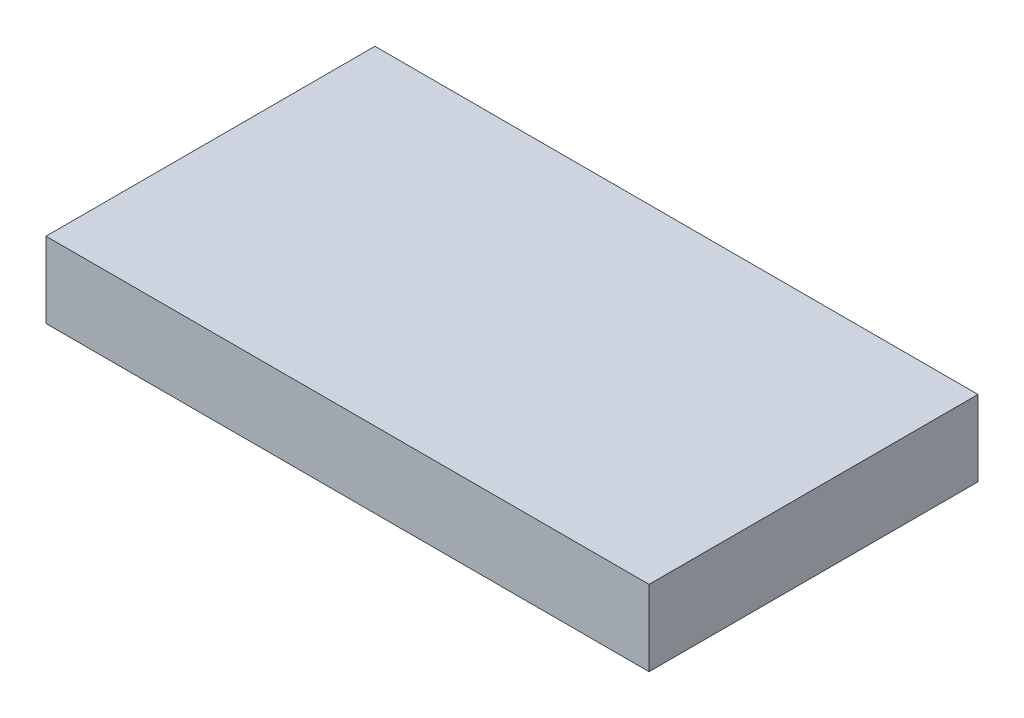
from build123d import *

# Parameters (mm, degrees)
SKETCH1_W           = 69.85
SKETCH1_H           = 38.1
BOSS_EXTRUDE1_DEPTH = 8.763


with BuildPart() as part:
    # Sketch1 → Boss-Extrude1 (new body)
    with BuildSketch(Plane(origin=(0, 0, 0), x_dir=(1, 0, 0), z_dir=(0, 1, 0))):
        with Locations((34.925, 19.05)):
            Rectangle(SKETCH1_W, SKETCH1_H)
    extrude(amount=BOSS_EXTRUDE1_DEPTH)


solid = part.part
